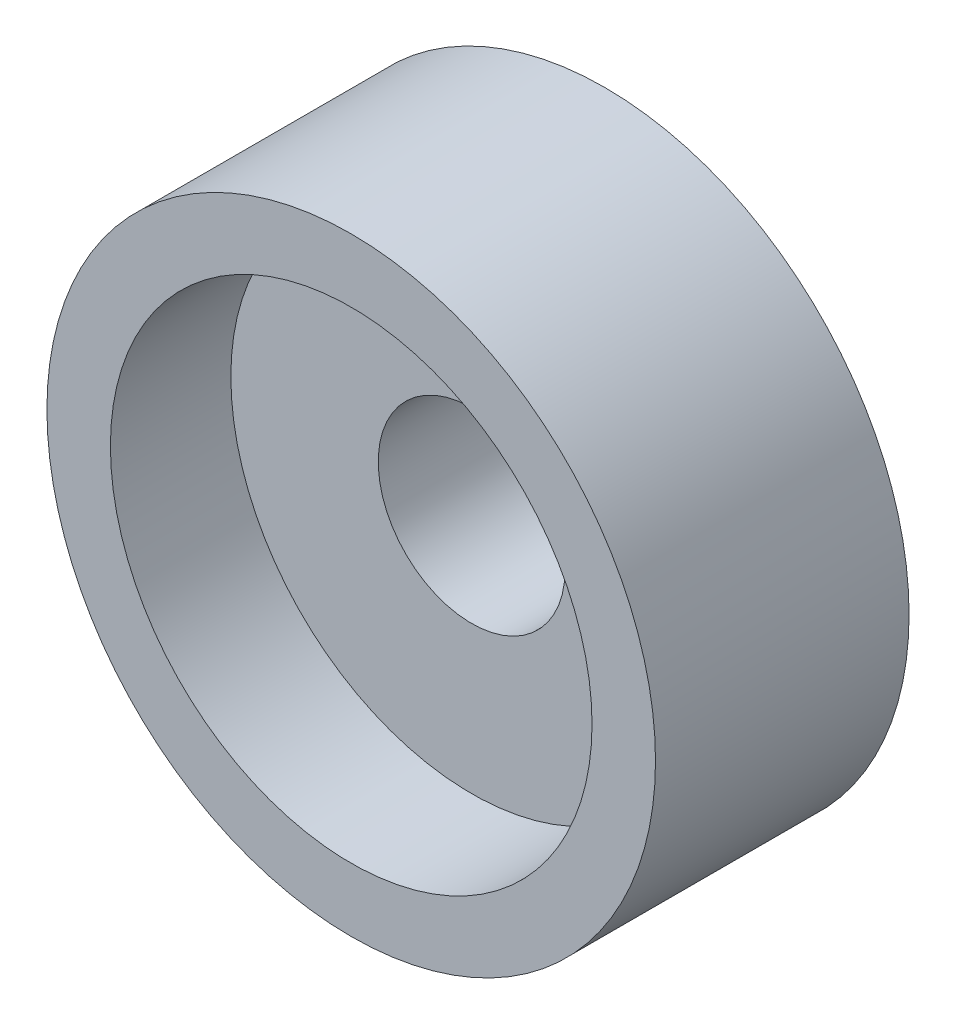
from build123d import *

# Parameters (mm, degrees)
SKETCH1_R          = 24
EXTRUDE1_DEPTH     = 20
SKETCH2_R          = 18.993506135
CUT_EXTRUDE1_DEPTH = 9.5
SKETCH3_R          = 7.367502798
CUT_EXTRUDE2_DEPTH = 36.528157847


with BuildPart() as part:
    # Sketch1 → Extrude1 (new body)
    with BuildSketch(Plane.XY):
        Circle(SKETCH1_R)
    extrude(amount=EXTRUDE1_DEPTH)

    # Sketch2 → Cut-Extrude1 (cut)
    with BuildSketch(Plane.XY.offset(20)):
        Circle(SKETCH2_R)
    extrude(amount=-CUT_EXTRUDE1_DEPTH, mode=Mode.SUBTRACT)

    # Sketch3 → Cut-Extrude2 (cut, through all)
    with BuildSketch(Plane.XY.offset(10.5)):
        Circle(SKETCH3_R)
    extrude(amount=-CUT_EXTRUDE2_DEPTH, mode=Mode.SUBTRACT)


solid = part.part
